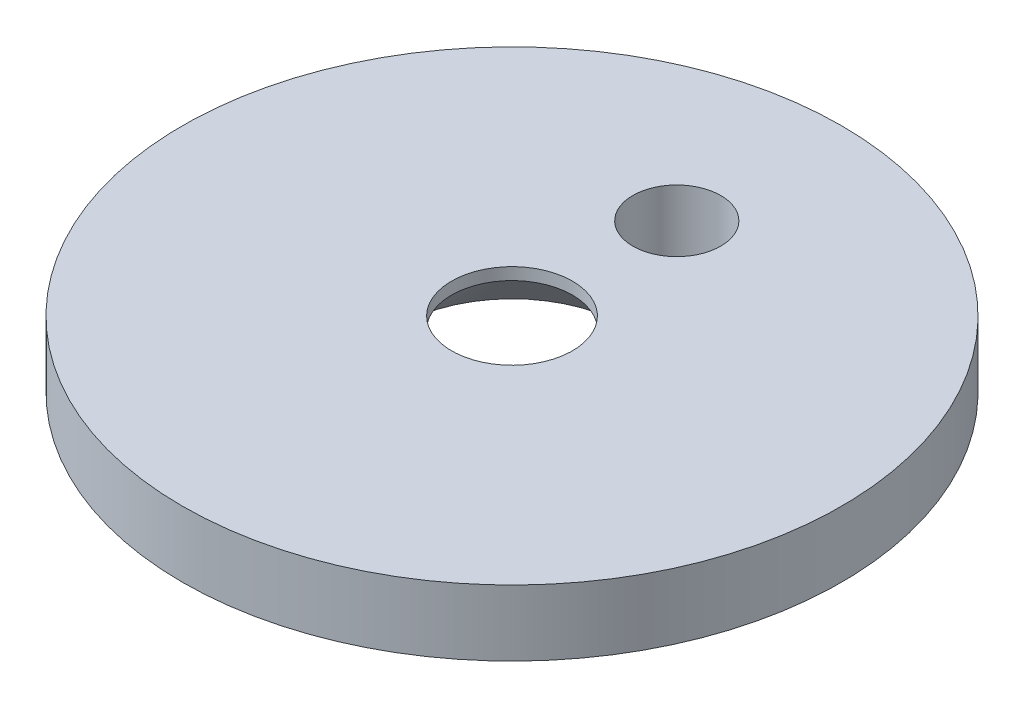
from build123d import *

# Parameters (mm, degrees)
SKETCH1_R      = 15
SKETCH1_R_2    = 2.5
SKETCH1_R_3    = 2
EXTRUDE1_DEPTH = 3


with BuildPart() as part:
    # Sketch1 → Extrude1 (new body)
    with BuildSketch(Plane(origin=(0, 0, 0), x_dir=(1, 0, 0), z_dir=(0, 1, 0))):
        with Locations(Location((0, 0, 0), (0, 0, 270))):
            Circle(SKETCH1_R)
        with Locations(Location((0, 0, 0), (0, 0, 270))):
            Circle(SKETCH1_R_2, mode=Mode.SUBTRACT)
        with Locations(Location((0, 7.5, 0), (0, 0, 270))):
            Circle(SKETCH1_R_3, mode=Mode.SUBTRACT)
    extrude(amount=EXTRUDE1_DEPTH)

    # Sketch6 → CSK for M5 Countersunk Flat Head Screw1 (revolve, cut)
    with BuildSketch(Plane(origin=(0, 0, 0), x_dir=(0, 0, -1), z_dir=(1, 0, 0))):
        Polygon((0, 0), (0, 3), (2.75, 3), (2.75, 2.45), (5.2, 0), align=None)
    revolve(axis=Axis((0, -6.35, 0), (0, 1, 0)), mode=Mode.SUBTRACT)


solid = part.part
